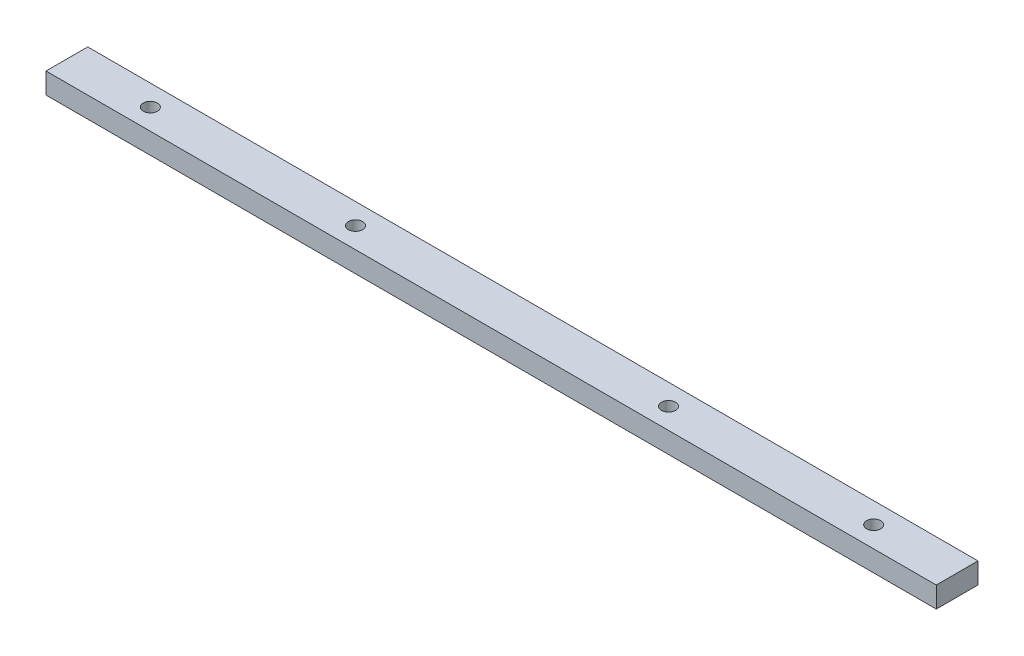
from build123d import *

# Parameters (mm, degrees)
ESQUISSE1_W             = 30
ESQUISSE1_H             = 15
EXTRUSION1_DEPTH        = 320
TROU_TARAUD_M12X1_751_D = 10.2


with BuildPart() as part:
    # Esquisse1 → Extrusion1 (new, symmetric)
    with BuildSketch(Plane(origin=(0, 0, 0), x_dir=(0, 0, -1), z_dir=(1, 0, 0))):
        with Locations((0, -7.5)):
            Rectangle(ESQUISSE1_W, ESQUISSE1_H)
    extrude(amount=EXTRUSION1_DEPTH, both=True)

    # Trou taraud_ M12x1.751 (through all)
    with Locations(Plane(origin=(0, 0, 0), x_dir=(-1, 0, 0), z_dir=(0, 1, 0))):
        with Locations((260, 0), (112.5, 0), (-112.5, 0), (-260, 0)):
            Hole(TROU_TARAUD_M12X1_751_D / 2)


solid = part.part
